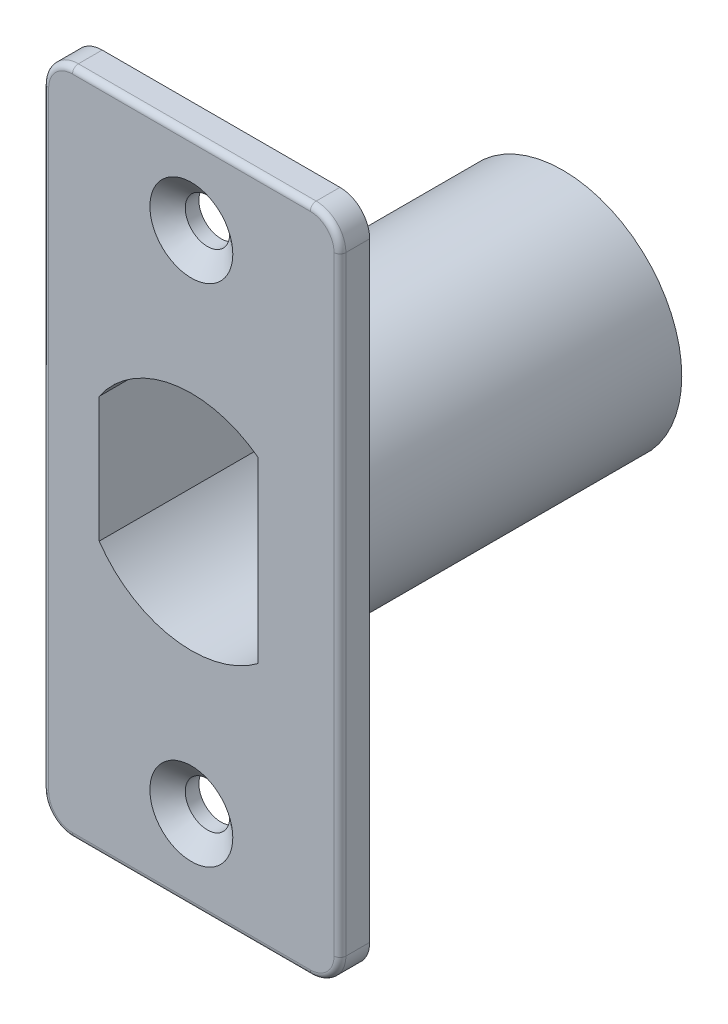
ISO-10303-21;
HEADER;
FILE_DESCRIPTION(('STEP AP214'),'2;1');
FILE_NAME('part.step','',(''),(''),'','','');
FILE_SCHEMA(('AUTOMOTIVE_DESIGN { 1 0 10303 214 1 1 1 1 }'));
ENDSEC;
DATA;
#1=APPLICATION_CONTEXT('core data for automotive mechanical design processes');
#2=APPLICATION_PROTOCOL_DEFINITION('international standard','automotive_design',2000,#1);
#3=PRODUCT_CONTEXT('',#1,'mechanical');
#4=PRODUCT('Part','Part','',(#3));
#5=PRODUCT_RELATED_PRODUCT_CATEGORY('part','',(#4));
#6=PRODUCT_DEFINITION_FORMATION('','',#4);
#7=PRODUCT_DEFINITION_CONTEXT('part definition',#1,'design');
#8=PRODUCT_DEFINITION('design','',#6,#7);
#9=PRODUCT_DEFINITION_SHAPE('','',#8);
#10=(LENGTH_UNIT() NAMED_UNIT(*) SI_UNIT(.MILLI.,.METRE.));
#11=(NAMED_UNIT(*) PLANE_ANGLE_UNIT() SI_UNIT($,.RADIAN.));
#12=(NAMED_UNIT(*) SI_UNIT($,.STERADIAN.) SOLID_ANGLE_UNIT());
#13=UNCERTAINTY_MEASURE_WITH_UNIT(LENGTH_MEASURE(1.E-05),#10,'distance_accuracy_value','');
#14=(GEOMETRIC_REPRESENTATION_CONTEXT(3) GLOBAL_UNCERTAINTY_ASSIGNED_CONTEXT((#13)) GLOBAL_UNIT_ASSIGNED_CONTEXT((#10,
#11,#12)) REPRESENTATION_CONTEXT('',''));
#15=CARTESIAN_POINT('',(0.,0.,0.));
#16=DIRECTION('',(0.,0.,1.));
#17=DIRECTION('',(1.,0.,0.));
#18=AXIS2_PLACEMENT_3D('',#15,#16,#17);
#19=CARTESIAN_POINT('',(5.715,7.62,-29.21));
#20=DIRECTION('',(1.,0.,0.));
#21=DIRECTION('',(0.,0.,-1.));
#22=AXIS2_PLACEMENT_3D('',#19,#20,#21);
#23=PLANE('',#22);
#24=DIRECTION('',(0.,-1.,0.));
#25=VECTOR('',#24,1.);
#26=CARTESIAN_POINT('',(5.715,-7.62,-27.94));
#27=LINE('',#26,#25);
#28=CARTESIAN_POINT('',(5.715,7.62,-27.94));
#29=VERTEX_POINT('',#28);
#30=CARTESIAN_POINT('',(5.715,-7.62,-27.94));
#31=VERTEX_POINT('',#30);
#32=EDGE_CURVE('E170',#29,#31,#27,.T.);
#33=ORIENTED_EDGE('',*,*,#32,.T.);
#34=DIRECTION('',(0.,0.,1.));
#35=VECTOR('',#34,1.);
#36=CARTESIAN_POINT('',(5.715,-7.62,-29.21));
#37=LINE('',#36,#35);
#38=CARTESIAN_POINT('',(5.715,-7.62,2.54));
#39=VERTEX_POINT('',#38);
#40=EDGE_CURVE('E182',#31,#39,#37,.T.);
#41=ORIENTED_EDGE('',*,*,#40,.T.);
#42=DIRECTION('',(0.,1.,0.));
#43=VECTOR('',#42,1.);
#44=CARTESIAN_POINT('',(5.715,7.62,2.54));
#45=LINE('',#44,#43);
#46=CARTESIAN_POINT('',(5.715,7.62,2.54));
#47=VERTEX_POINT('',#46);
#48=EDGE_CURVE('E206',#39,#47,#45,.T.);
#49=ORIENTED_EDGE('',*,*,#48,.T.);
#50=DIRECTION('',(0.,0.,1.));
#51=VECTOR('',#50,1.);
#52=CARTESIAN_POINT('',(5.715,7.62,-29.21));
#53=LINE('',#52,#51);
#54=EDGE_CURVE('E221',#29,#47,#53,.T.);
#55=ORIENTED_EDGE('',*,*,#54,.F.);
#56=EDGE_LOOP('',(#33,#41,#49,#55));
#57=FACE_BOUND('',#56,.T.);
#58=ADVANCED_FACE('F32',(#57),#23,.F.);
#59=CARTESIAN_POINT('',(12.7,-28.575,2.54));
#60=DIRECTION('',(-1.,0.,0.));
#61=DIRECTION('',(0.,0.,1.));
#62=AXIS2_PLACEMENT_3D('',#59,#60,#61);
#63=PLANE('',#62);
#64=DIRECTION('',(0.,0.,-1.));
#65=VECTOR('',#64,1.);
#66=CARTESIAN_POINT('',(12.7,26.035,2.54));
#67=LINE('',#66,#65);
#68=CARTESIAN_POINT('',(12.7,26.035,0.));
#69=VERTEX_POINT('',#68);
#70=CARTESIAN_POINT('',(12.7,26.035,2.032));
#71=VERTEX_POINT('',#70);
#72=EDGE_CURVE('E246',#69,#71,#67,.F.);
#73=ORIENTED_EDGE('',*,*,#72,.T.);
#74=DIRECTION('',(0.,1.,0.));
#75=VECTOR('',#74,1.);
#76=CARTESIAN_POINT('',(12.7,-28.575,2.032));
#77=LINE('',#76,#75);
#78=CARTESIAN_POINT('',(12.7,-26.035,2.032));
#79=VERTEX_POINT('',#78);
#80=EDGE_CURVE('E300',#71,#79,#77,.F.);
#81=ORIENTED_EDGE('',*,*,#80,.T.);
#82=DIRECTION('',(0.,0.,-1.));
#83=VECTOR('',#82,1.);
#84=CARTESIAN_POINT('',(12.7,-26.035,2.54));
#85=LINE('',#84,#83);
#86=CARTESIAN_POINT('',(12.7,-26.035,0.));
#87=VERTEX_POINT('',#86);
#88=EDGE_CURVE('E253',#79,#87,#85,.T.);
#89=ORIENTED_EDGE('',*,*,#88,.T.);
#90=DIRECTION('',(0.,1.,0.));
#91=VECTOR('',#90,1.);
#92=CARTESIAN_POINT('',(12.7,-28.575,0.));
#93=LINE('',#92,#91);
#94=EDGE_CURVE('E231',#87,#69,#93,.T.);
#95=ORIENTED_EDGE('',*,*,#94,.T.);
#96=EDGE_LOOP('',(#73,#81,#89,#95));
#97=FACE_BOUND('',#96,.T.);
#98=ADVANCED_FACE('F352',(#97),#63,.F.);
#99=CARTESIAN_POINT('',(-12.7,28.575,2.54));
#100=DIRECTION('',(0.,-1.,0.));
#101=DIRECTION('',(0.,0.,-1.));
#102=AXIS2_PLACEMENT_3D('',#99,#100,#101);
#103=PLANE('',#102);
#104=DIRECTION('',(0.,0.,-1.));
#105=VECTOR('',#104,1.);
#106=CARTESIAN_POINT('',(-10.16,28.575,2.54));
#107=LINE('',#106,#105);
#108=CARTESIAN_POINT('',(-10.16,28.575,0.));
#109=VERTEX_POINT('',#108);
#110=CARTESIAN_POINT('',(-10.16,28.575,2.032));
#111=VERTEX_POINT('',#110);
#112=EDGE_CURVE('E273',#109,#111,#107,.F.);
#113=ORIENTED_EDGE('',*,*,#112,.T.);
#114=DIRECTION('',(-1.,0.,0.));
#115=VECTOR('',#114,1.);
#116=CARTESIAN_POINT('',(-12.7,28.575,2.032));
#117=LINE('',#116,#115);
#118=CARTESIAN_POINT('',(10.16,28.575,2.032));
#119=VERTEX_POINT('',#118);
#120=EDGE_CURVE('E296',#111,#119,#117,.F.);
#121=ORIENTED_EDGE('',*,*,#120,.T.);
#122=DIRECTION('',(0.,0.,-1.));
#123=VECTOR('',#122,1.);
#124=CARTESIAN_POINT('',(10.16,28.575,2.54));
#125=LINE('',#124,#123);
#126=CARTESIAN_POINT('',(10.16,28.575,0.));
#127=VERTEX_POINT('',#126);
#128=EDGE_CURVE('E271',#119,#127,#125,.T.);
#129=ORIENTED_EDGE('',*,*,#128,.T.);
#130=DIRECTION('',(-1.,0.,0.));
#131=VECTOR('',#130,1.);
#132=CARTESIAN_POINT('',(-12.7,28.575,0.));
#133=LINE('',#132,#131);
#134=EDGE_CURVE('E234',#127,#109,#133,.T.);
#135=ORIENTED_EDGE('',*,*,#134,.T.);
#136=EDGE_LOOP('',(#113,#121,#129,#135));
#137=FACE_BOUND('',#136,.T.);
#138=ADVANCED_FACE('F404',(#137),#103,.F.);
#139=CARTESIAN_POINT('',(-12.7,-28.575,2.54));
#140=DIRECTION('',(1.,0.,0.));
#141=DIRECTION('',(0.,0.,-1.));
#142=AXIS2_PLACEMENT_3D('',#139,#140,#141);
#143=PLANE('',#142);
#144=DIRECTION('',(0.,0.,-1.));
#145=VECTOR('',#144,1.);
#146=CARTESIAN_POINT('',(-12.7,-26.035,2.54));
#147=LINE('',#146,#145);
#148=CARTESIAN_POINT('',(-12.7,-26.035,0.));
#149=VERTEX_POINT('',#148);
#150=CARTESIAN_POINT('',(-12.7,-26.035,2.032));
#151=VERTEX_POINT('',#150);
#152=EDGE_CURVE('E269',#149,#151,#147,.F.);
#153=ORIENTED_EDGE('',*,*,#152,.T.);
#154=DIRECTION('',(0.,-1.,0.));
#155=VECTOR('',#154,1.);
#156=CARTESIAN_POINT('',(-12.7,-28.575,2.032));
#157=LINE('',#156,#155);
#158=CARTESIAN_POINT('',(-12.7,26.035,2.032));
#159=VERTEX_POINT('',#158);
#160=EDGE_CURVE('E11',#151,#159,#157,.F.);
#161=ORIENTED_EDGE('',*,*,#160,.T.);
#162=DIRECTION('',(0.,0.,-1.));
#163=VECTOR('',#162,1.);
#164=CARTESIAN_POINT('',(-12.7,26.035,2.54));
#165=LINE('',#164,#163);
#166=CARTESIAN_POINT('',(-12.7,26.035,0.));
#167=VERTEX_POINT('',#166);
#168=EDGE_CURVE('E267',#159,#167,#165,.T.);
#169=ORIENTED_EDGE('',*,*,#168,.T.);
#170=DIRECTION('',(0.,-1.,0.));
#171=VECTOR('',#170,1.);
#172=CARTESIAN_POINT('',(-12.7,-28.575,0.));
#173=LINE('',#172,#171);
#174=EDGE_CURVE('E237',#167,#149,#173,.T.);
#175=ORIENTED_EDGE('',*,*,#174,.T.);
#176=EDGE_LOOP('',(#153,#161,#169,#175));
#177=FACE_BOUND('',#176,.T.);
#178=ADVANCED_FACE('F383',(#177),#143,.F.);
#179=CARTESIAN_POINT('',(-12.7,-28.575,2.54));
#180=DIRECTION('',(0.,1.,0.));
#181=DIRECTION('',(0.,0.,1.));
#182=AXIS2_PLACEMENT_3D('',#179,#180,#181);
#183=PLANE('',#182);
#184=DIRECTION('',(0.,0.,-1.));
#185=VECTOR('',#184,1.);
#186=CARTESIAN_POINT('',(10.16,-28.575,2.54));
#187=LINE('',#186,#185);
#188=CARTESIAN_POINT('',(10.16,-28.575,0.));
#189=VERTEX_POINT('',#188);
#190=CARTESIAN_POINT('',(10.16,-28.575,2.032));
#191=VERTEX_POINT('',#190);
#192=EDGE_CURVE('E265',#189,#191,#187,.F.);
#193=ORIENTED_EDGE('',*,*,#192,.T.);
#194=DIRECTION('',(1.,0.,0.));
#195=VECTOR('',#194,1.);
#196=CARTESIAN_POINT('',(-12.7,-28.575,2.032));
#197=LINE('',#196,#195);
#198=CARTESIAN_POINT('',(-10.16,-28.575,2.032));
#199=VERTEX_POINT('',#198);
#200=EDGE_CURVE('E56',#191,#199,#197,.F.);
#201=ORIENTED_EDGE('',*,*,#200,.T.);
#202=DIRECTION('',(0.,0.,-1.));
#203=VECTOR('',#202,1.);
#204=CARTESIAN_POINT('',(-10.16,-28.575,2.54));
#205=LINE('',#204,#203);
#206=CARTESIAN_POINT('',(-10.16,-28.575,0.));
#207=VERTEX_POINT('',#206);
#208=EDGE_CURVE('E263',#199,#207,#205,.T.);
#209=ORIENTED_EDGE('',*,*,#208,.T.);
#210=DIRECTION('',(1.,0.,0.));
#211=VECTOR('',#210,1.);
#212=CARTESIAN_POINT('',(-12.7,-28.575,0.));
#213=LINE('',#212,#211);
#214=EDGE_CURVE('E240',#207,#189,#213,.T.);
#215=ORIENTED_EDGE('',*,*,#214,.T.);
#216=EDGE_LOOP('',(#193,#201,#209,#215));
#217=FACE_BOUND('',#216,.T.);
#218=ADVANCED_FACE('F341',(#217),#183,.F.);
#219=CARTESIAN_POINT('',(12.7,28.575,2.54));
#220=DIRECTION('',(0.,0.,-1.));
#221=DIRECTION('',(-1.,0.,0.));
#222=AXIS2_PLACEMENT_3D('',#219,#220,#221);
#223=PLANE('',#222);
#224=DIRECTION('',(-1.,0.,0.));
#225=VECTOR('',#224,1.);
#226=CARTESIAN_POINT('',(12.7,28.067,2.54));
#227=LINE('',#226,#225);
#228=CARTESIAN_POINT('',(10.16,28.067,2.54));
#229=VERTEX_POINT('',#228);
#230=CARTESIAN_POINT('',(-10.16,28.067,2.54));
#231=VERTEX_POINT('',#230);
#232=EDGE_CURVE('E288',#229,#231,#227,.T.);
#233=ORIENTED_EDGE('',*,*,#232,.T.);
#234=CARTESIAN_POINT('',(-10.16,26.035,2.54));
#235=DIRECTION('',(0.,0.,-1.));
#236=DIRECTION('',(-1.,0.,0.));
#237=AXIS2_PLACEMENT_3D('',#234,#235,#236);
#238=CIRCLE('',#237,2.032);
#239=CARTESIAN_POINT('',(-12.192,26.035,2.54));
#240=VERTEX_POINT('',#239);
#241=EDGE_CURVE('E290',#231,#240,#238,.F.);
#242=ORIENTED_EDGE('',*,*,#241,.T.);
#243=DIRECTION('',(0.,-1.,0.));
#244=VECTOR('',#243,1.);
#245=CARTESIAN_POINT('',(-12.192,28.575,2.54));
#246=LINE('',#245,#244);
#247=CARTESIAN_POINT('',(-12.192,-26.035,2.54));
#248=VERTEX_POINT('',#247);
#249=EDGE_CURVE('E276',#240,#248,#246,.T.);
#250=ORIENTED_EDGE('',*,*,#249,.T.);
#251=CARTESIAN_POINT('',(-10.16,-26.035,2.54));
#252=DIRECTION('',(0.,0.,-1.));
#253=DIRECTION('',(-1.,0.,0.));
#254=AXIS2_PLACEMENT_3D('',#251,#252,#253);
#255=CIRCLE('',#254,2.032);
#256=CARTESIAN_POINT('',(-10.16,-28.067,2.54));
#257=VERTEX_POINT('',#256);
#258=EDGE_CURVE('E278',#248,#257,#255,.F.);
#259=ORIENTED_EDGE('',*,*,#258,.T.);
#260=DIRECTION('',(1.,0.,0.));
#261=VECTOR('',#260,1.);
#262=CARTESIAN_POINT('',(12.7,-28.067,2.54));
#263=LINE('',#262,#261);
#264=CARTESIAN_POINT('',(10.16,-28.067,2.54));
#265=VERTEX_POINT('',#264);
#266=EDGE_CURVE('E280',#257,#265,#263,.T.);
#267=ORIENTED_EDGE('',*,*,#266,.T.);
#268=CARTESIAN_POINT('',(10.16,-26.035,2.54));
#269=DIRECTION('',(0.,0.,-1.));
#270=DIRECTION('',(-1.,0.,0.));
#271=AXIS2_PLACEMENT_3D('',#268,#269,#270);
#272=CIRCLE('',#271,2.032);
#273=CARTESIAN_POINT('',(12.192,-26.035,2.54));
#274=VERTEX_POINT('',#273);
#275=EDGE_CURVE('E282',#265,#274,#272,.F.);
#276=ORIENTED_EDGE('',*,*,#275,.T.);
#277=DIRECTION('',(0.,1.,0.));
#278=VECTOR('',#277,1.);
#279=CARTESIAN_POINT('',(12.192,28.575,2.54));
#280=LINE('',#279,#278);
#281=CARTESIAN_POINT('',(12.192,26.035,2.54));
#282=VERTEX_POINT('',#281);
#283=EDGE_CURVE('E284',#274,#282,#280,.T.);
#284=ORIENTED_EDGE('',*,*,#283,.T.);
#285=CARTESIAN_POINT('',(10.16,26.035,2.54));
#286=DIRECTION('',(0.,0.,-1.));
#287=DIRECTION('',(-1.,0.,0.));
#288=AXIS2_PLACEMENT_3D('',#285,#286,#287);
#289=CIRCLE('',#288,2.032);
#290=EDGE_CURVE('E286',#282,#229,#289,.F.);
#291=ORIENTED_EDGE('',*,*,#290,.T.);
#292=EDGE_LOOP('',(#233,#242,#250,#259,#267,#276,#284,#291));
#293=FACE_BOUND('',#292,.T.);
#294=CARTESIAN_POINT('',(0.,21.59,2.54));
#295=DIRECTION('',(0.,0.,1.));
#296=DIRECTION('',(1.,0.,0.));
#297=AXIS2_PLACEMENT_3D('',#294,#295,#296);
#298=CIRCLE('',#297,3.5433);
#299=CARTESIAN_POINT('',(3.5433,21.59,2.54));
#300=VERTEX_POINT('',#299);
#301=EDGE_CURVE('E188',#300,#300,#298,.T.);
#302=ORIENTED_EDGE('',*,*,#301,.F.);
#303=EDGE_LOOP('',(#302));
#304=FACE_BOUND('',#303,.T.);
#305=CARTESIAN_POINT('',(0.,-21.59,2.54));
#306=DIRECTION('',(0.,0.,1.));
#307=DIRECTION('',(1.,0.,0.));
#308=AXIS2_PLACEMENT_3D('',#305,#306,#307);
#309=CIRCLE('',#308,3.5433);
#310=CARTESIAN_POINT('',(3.5433,-21.59,2.54));
#311=VERTEX_POINT('',#310);
#312=EDGE_CURVE('E196',#311,#311,#309,.T.);
#313=ORIENTED_EDGE('',*,*,#312,.F.);
#314=EDGE_LOOP('',(#313));
#315=FACE_BOUND('',#314,.T.);
#316=DIRECTION('',(0.,-1.,0.));
#317=VECTOR('',#316,1.);
#318=CARTESIAN_POINT('',(-7.87416386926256,5.3594,2.54));
#319=LINE('',#318,#317);
#320=CARTESIAN_POINT('',(-7.87416386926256,5.3594,2.54));
#321=VERTEX_POINT('',#320);
#322=CARTESIAN_POINT('',(-7.87416386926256,-5.3594,2.54));
#323=VERTEX_POINT('',#322);
#324=EDGE_CURVE('E214',#321,#323,#319,.T.);
#325=ORIENTED_EDGE('',*,*,#324,.F.);
#326=CARTESIAN_POINT('',(0.,0.,2.54));
#327=DIRECTION('',(0.,0.,1.));
#328=DIRECTION('',(1.,0.,0.));
#329=AXIS2_PLACEMENT_3D('',#326,#327,#328);
#330=CIRCLE('',#329,9.525);
#331=EDGE_CURVE('E212',#47,#321,#330,.T.);
#332=ORIENTED_EDGE('',*,*,#331,.F.);
#333=ORIENTED_EDGE('',*,*,#48,.F.);
#334=CARTESIAN_POINT('',(0.,0.,2.54));
#335=DIRECTION('',(0.,0.,1.));
#336=DIRECTION('',(1.,0.,0.));
#337=AXIS2_PLACEMENT_3D('',#334,#335,#336);
#338=CIRCLE('',#337,9.525);
#339=EDGE_CURVE('E217',#323,#39,#338,.T.);
#340=ORIENTED_EDGE('',*,*,#339,.F.);
#341=EDGE_LOOP('',(#325,#332,#333,#340));
#342=FACE_BOUND('',#341,.T.);
#343=ADVANCED_FACE('F368',(#293,#304,#315,#342),#223,.F.);
#344=CARTESIAN_POINT('',(12.7,28.575,0.));
#345=DIRECTION('',(0.,0.,-1.));
#346=DIRECTION('',(-1.,0.,0.));
#347=AXIS2_PLACEMENT_3D('',#344,#345,#346);
#348=PLANE('',#347);
#349=CARTESIAN_POINT('',(0.,21.59,0.));
#350=DIRECTION('',(0.,0.,-1.));
#351=DIRECTION('',(-1.,0.,0.));
#352=AXIS2_PLACEMENT_3D('',#349,#350,#351);
#353=CIRCLE('',#352,1.89864999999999);
#354=CARTESIAN_POINT('',(-1.89864999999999,21.59,0.));
#355=VERTEX_POINT('',#354);
#356=EDGE_CURVE('E195',#355,#355,#353,.T.);
#357=ORIENTED_EDGE('',*,*,#356,.F.);
#358=EDGE_LOOP('',(#357));
#359=FACE_BOUND('',#358,.T.);
#360=CARTESIAN_POINT('',(0.,-21.59,0.));
#361=DIRECTION('',(0.,0.,-1.));
#362=DIRECTION('',(-1.,0.,0.));
#363=AXIS2_PLACEMENT_3D('',#360,#361,#362);
#364=CIRCLE('',#363,1.89864999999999);
#365=CARTESIAN_POINT('',(-1.89864999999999,-21.59,0.));
#366=VERTEX_POINT('',#365);
#367=EDGE_CURVE('E202',#366,#366,#364,.T.);
#368=ORIENTED_EDGE('',*,*,#367,.F.);
#369=EDGE_LOOP('',(#368));
#370=FACE_BOUND('',#369,.T.);
#371=CARTESIAN_POINT('',(0.,0.,0.));
#372=DIRECTION('',(0.,0.,-1.));
#373=DIRECTION('',(-1.,0.,0.));
#374=AXIS2_PLACEMENT_3D('',#371,#372,#373);
#375=CIRCLE('',#374,10.16);
#376=CARTESIAN_POINT('',(-10.16,0.,0.));
#377=VERTEX_POINT('',#376);
#378=EDGE_CURVE('E243',#377,#377,#375,.T.);
#379=ORIENTED_EDGE('',*,*,#378,.F.);
#380=EDGE_LOOP('',(#379));
#381=FACE_BOUND('',#380,.T.);
#382=ORIENTED_EDGE('',*,*,#94,.F.);
#383=CARTESIAN_POINT('',(10.16,-26.035,0.));
#384=DIRECTION('',(0.,0.,-1.));
#385=DIRECTION('',(-1.,0.,0.));
#386=AXIS2_PLACEMENT_3D('',#383,#384,#385);
#387=CIRCLE('',#386,2.54);
#388=EDGE_CURVE('E261',#87,#189,#387,.T.);
#389=ORIENTED_EDGE('',*,*,#388,.T.);
#390=ORIENTED_EDGE('',*,*,#214,.F.);
#391=CARTESIAN_POINT('',(-10.16,-26.035,0.));
#392=DIRECTION('',(0.,0.,-1.));
#393=DIRECTION('',(-1.,0.,0.));
#394=AXIS2_PLACEMENT_3D('',#391,#392,#393);
#395=CIRCLE('',#394,2.54);
#396=EDGE_CURVE('E259',#207,#149,#395,.T.);
#397=ORIENTED_EDGE('',*,*,#396,.T.);
#398=ORIENTED_EDGE('',*,*,#174,.F.);
#399=CARTESIAN_POINT('',(-10.16,26.035,0.));
#400=DIRECTION('',(0.,0.,-1.));
#401=DIRECTION('',(-1.,0.,0.));
#402=AXIS2_PLACEMENT_3D('',#399,#400,#401);
#403=CIRCLE('',#402,2.54);
#404=EDGE_CURVE('E257',#167,#109,#403,.T.);
#405=ORIENTED_EDGE('',*,*,#404,.T.);
#406=ORIENTED_EDGE('',*,*,#134,.F.);
#407=CARTESIAN_POINT('',(10.16,26.035,0.));
#408=DIRECTION('',(0.,0.,-1.));
#409=DIRECTION('',(-1.,0.,0.));
#410=AXIS2_PLACEMENT_3D('',#407,#408,#409);
#411=CIRCLE('',#410,2.54);
#412=EDGE_CURVE('E255',#127,#69,#411,.T.);
#413=ORIENTED_EDGE('',*,*,#412,.T.);
#414=EDGE_LOOP('',(#382,#389,#390,#397,#398,#405,#406,#413));
#415=FACE_BOUND('',#414,.T.);
#416=ADVANCED_FACE('F346',(#359,#370,#381,#415),#348,.T.);
#417=CARTESIAN_POINT('',(0.,0.,-29.21));
#418=DIRECTION('',(0.,0.,1.));
#419=DIRECTION('',(1.,0.,0.));
#420=AXIS2_PLACEMENT_3D('',#417,#418,#419);
#421=CYLINDRICAL_SURFACE('',#420,10.16);
#422=ORIENTED_EDGE('',*,*,#378,.T.);
#423=EDGE_LOOP('',(#422));
#424=FACE_BOUND('',#423,.T.);
#425=CARTESIAN_POINT('',(0.,0.,-29.21));
#426=DIRECTION('',(0.,0.,1.));
#427=DIRECTION('',(1.,0.,0.));
#428=AXIS2_PLACEMENT_3D('',#425,#426,#427);
#429=CIRCLE('',#428,10.16);
#430=CARTESIAN_POINT('',(10.16,0.,-29.21));
#431=VERTEX_POINT('',#430);
#432=EDGE_CURVE('E223',#431,#431,#429,.T.);
#433=ORIENTED_EDGE('',*,*,#432,.T.);
#434=EDGE_LOOP('',(#433));
#435=FACE_BOUND('',#434,.T.);
#436=ADVANCED_FACE('F423',(#424,#435),#421,.T.);
#437=CARTESIAN_POINT('',(0.,0.,-29.21));
#438=DIRECTION('',(0.,0.,1.));
#439=DIRECTION('',(1.,0.,0.));
#440=AXIS2_PLACEMENT_3D('',#437,#438,#439);
#441=PLANE('',#440);
#442=DIRECTION('',(0.,1.,0.));
#443=VECTOR('',#442,1.);
#444=CARTESIAN_POINT('',(0.,9.525,-29.21));
#445=LINE('',#444,#443);
#446=CARTESIAN_POINT('',(0.,-9.525,-29.21));
#447=VERTEX_POINT('',#446);
#448=CARTESIAN_POINT('',(0.,9.525,-29.21));
#449=VERTEX_POINT('',#448);
#450=EDGE_CURVE('E165',#447,#449,#445,.T.);
#451=ORIENTED_EDGE('',*,*,#450,.T.);
#452=CARTESIAN_POINT('',(0.,0.,-29.21));
#453=DIRECTION('',(0.,0.,1.));
#454=DIRECTION('',(1.,0.,0.));
#455=AXIS2_PLACEMENT_3D('',#452,#453,#454);
#456=CIRCLE('',#455,9.525);
#457=CARTESIAN_POINT('',(-7.87416386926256,5.3594,-29.21));
#458=VERTEX_POINT('',#457);
#459=EDGE_CURVE('E203',#449,#458,#456,.T.);
#460=ORIENTED_EDGE('',*,*,#459,.T.);
#461=DIRECTION('',(0.,-1.,0.));
#462=VECTOR('',#461,1.);
#463=CARTESIAN_POINT('',(-7.87416386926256,5.3594,-29.21));
#464=LINE('',#463,#462);
#465=CARTESIAN_POINT('',(-7.87416386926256,-5.3594,-29.21));
#466=VERTEX_POINT('',#465);
#467=EDGE_CURVE('E205',#458,#466,#464,.T.);
#468=ORIENTED_EDGE('',*,*,#467,.T.);
#469=CARTESIAN_POINT('',(0.,0.,-29.21));
#470=DIRECTION('',(0.,0.,1.));
#471=DIRECTION('',(1.,0.,0.));
#472=AXIS2_PLACEMENT_3D('',#469,#470,#471);
#473=CIRCLE('',#472,9.525);
#474=EDGE_CURVE('E209',#466,#447,#473,.T.);
#475=ORIENTED_EDGE('',*,*,#474,.T.);
#476=EDGE_LOOP('',(#451,#460,#468,#475));
#477=FACE_BOUND('',#476,.T.);
#478=ORIENTED_EDGE('',*,*,#432,.F.);
#479=EDGE_LOOP('',(#478));
#480=FACE_BOUND('',#479,.T.);
#481=ADVANCED_FACE('F419',(#477,#480),#441,.F.);
#482=CARTESIAN_POINT('',(0.,0.,-29.21));
#483=DIRECTION('',(0.,0.,1.));
#484=DIRECTION('',(1.,0.,0.));
#485=AXIS2_PLACEMENT_3D('',#482,#483,#484);
#486=CYLINDRICAL_SURFACE('',#485,9.525);
#487=ORIENTED_EDGE('',*,*,#459,.F.);
#488=DIRECTION('',(0.,0.,-1.));
#489=VECTOR('',#488,1.);
#490=CARTESIAN_POINT('',(0.,9.525,-27.94));
#491=LINE('',#490,#489);
#492=CARTESIAN_POINT('',(0.,9.525,-27.94));
#493=VERTEX_POINT('',#492);
#494=EDGE_CURVE('E169',#493,#449,#491,.T.);
#495=ORIENTED_EDGE('',*,*,#494,.F.);
#496=CARTESIAN_POINT('',(0.,0.,-27.94));
#497=DIRECTION('',(0.,0.,-1.));
#498=DIRECTION('',(-1.,0.,0.));
#499=AXIS2_PLACEMENT_3D('',#496,#497,#498);
#500=CIRCLE('',#499,9.525);
#501=EDGE_CURVE('E177',#493,#29,#500,.T.);
#502=ORIENTED_EDGE('',*,*,#501,.T.);
#503=ORIENTED_EDGE('',*,*,#54,.T.);
#504=ORIENTED_EDGE('',*,*,#331,.T.);
#505=DIRECTION('',(0.,0.,1.));
#506=VECTOR('',#505,1.);
#507=CARTESIAN_POINT('',(-7.87416386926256,5.3594,-29.21));
#508=LINE('',#507,#506);
#509=EDGE_CURVE('E211',#458,#321,#508,.T.);
#510=ORIENTED_EDGE('',*,*,#509,.F.);
#511=EDGE_LOOP('',(#487,#495,#502,#503,#504,#510));
#512=FACE_BOUND('',#511,.T.);
#513=ADVANCED_FACE('F413',(#512),#486,.F.);
#514=CARTESIAN_POINT('',(0.,0.,-29.21));
#515=DIRECTION('',(0.,0.,1.));
#516=DIRECTION('',(1.,0.,0.));
#517=AXIS2_PLACEMENT_3D('',#514,#515,#516);
#518=CYLINDRICAL_SURFACE('',#517,9.525);
#519=CARTESIAN_POINT('',(0.,0.,-27.94));
#520=DIRECTION('',(0.,0.,-1.));
#521=DIRECTION('',(-1.,0.,0.));
#522=AXIS2_PLACEMENT_3D('',#519,#520,#521);
#523=CIRCLE('',#522,9.525);
#524=CARTESIAN_POINT('',(0.,-9.525,-27.94));
#525=VERTEX_POINT('',#524);
#526=EDGE_CURVE('E174',#31,#525,#523,.T.);
#527=ORIENTED_EDGE('',*,*,#526,.T.);
#528=DIRECTION('',(0.,0.,-1.));
#529=VECTOR('',#528,1.);
#530=CARTESIAN_POINT('',(0.,-9.525,-27.94));
#531=LINE('',#530,#529);
#532=EDGE_CURVE('E159',#525,#447,#531,.T.);
#533=ORIENTED_EDGE('',*,*,#532,.T.);
#534=ORIENTED_EDGE('',*,*,#474,.F.);
#535=DIRECTION('',(0.,0.,1.));
#536=VECTOR('',#535,1.);
#537=CARTESIAN_POINT('',(-7.87416386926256,-5.3594,-29.21));
#538=LINE('',#537,#536);
#539=EDGE_CURVE('E225',#466,#323,#538,.T.);
#540=ORIENTED_EDGE('',*,*,#539,.T.);
#541=ORIENTED_EDGE('',*,*,#339,.T.);
#542=ORIENTED_EDGE('',*,*,#40,.F.);
#543=EDGE_LOOP('',(#527,#533,#534,#540,#541,#542));
#544=FACE_BOUND('',#543,.T.);
#545=ADVANCED_FACE('F180',(#544),#518,.F.);
#546=CARTESIAN_POINT('',(-7.87416386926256,5.3594,-29.21));
#547=DIRECTION('',(-1.,0.,0.));
#548=DIRECTION('',(0.,0.,1.));
#549=AXIS2_PLACEMENT_3D('',#546,#547,#548);
#550=PLANE('',#549);
#551=ORIENTED_EDGE('',*,*,#324,.T.);
#552=ORIENTED_EDGE('',*,*,#539,.F.);
#553=ORIENTED_EDGE('',*,*,#467,.F.);
#554=ORIENTED_EDGE('',*,*,#509,.T.);
#555=EDGE_LOOP('',(#551,#552,#553,#554));
#556=FACE_BOUND('',#555,.T.);
#557=ADVANCED_FACE('F412',(#556),#550,.F.);
#558=CARTESIAN_POINT('',(0.,-21.59,2.54));
#559=DIRECTION('',(0.,0.,1.));
#560=DIRECTION('',(1.,0.,0.));
#561=AXIS2_PLACEMENT_3D('',#558,#559,#560);
#562=CYLINDRICAL_SURFACE('',#561,1.89864999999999);
#563=ORIENTED_EDGE('',*,*,#367,.T.);
#564=EDGE_LOOP('',(#563));
#565=FACE_BOUND('',#564,.T.);
#566=CARTESIAN_POINT('',(0.,-21.59,1.15997479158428));
#567=DIRECTION('',(0.,0.,1.));
#568=DIRECTION('',(1.,0.,0.));
#569=AXIS2_PLACEMENT_3D('',#566,#567,#568);
#570=CIRCLE('',#569,1.89865);
#571=CARTESIAN_POINT('',(1.89865,-21.59,1.15997479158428));
#572=VERTEX_POINT('',#571);
#573=EDGE_CURVE('E199',#572,#572,#570,.T.);
#574=ORIENTED_EDGE('',*,*,#573,.T.);
#575=EDGE_LOOP('',(#574));
#576=FACE_BOUND('',#575,.T.);
#577=ADVANCED_FACE('F408',(#565,#576),#562,.F.);
#578=CARTESIAN_POINT('',(0.,-21.59,2.54));
#579=DIRECTION('',(0.,0.,1.));
#580=DIRECTION('',(1.,0.,0.));
#581=AXIS2_PLACEMENT_3D('',#578,#579,#580);
#582=CONICAL_SURFACE('',#581,3.5433,0.872664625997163);
#583=ORIENTED_EDGE('',*,*,#573,.F.);
#584=EDGE_LOOP('',(#583));
#585=FACE_BOUND('',#584,.T.);
#586=ORIENTED_EDGE('',*,*,#312,.T.);
#587=EDGE_LOOP('',(#586));
#588=FACE_BOUND('',#587,.T.);
#589=ADVANCED_FACE('F570',(#585,#588),#582,.F.);
#590=CARTESIAN_POINT('',(0.,21.59,2.54));
#591=DIRECTION('',(0.,0.,1.));
#592=DIRECTION('',(1.,0.,0.));
#593=AXIS2_PLACEMENT_3D('',#590,#591,#592);
#594=CYLINDRICAL_SURFACE('',#593,1.89864999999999);
#595=ORIENTED_EDGE('',*,*,#356,.T.);
#596=EDGE_LOOP('',(#595));
#597=FACE_BOUND('',#596,.T.);
#598=CARTESIAN_POINT('',(0.,21.59,1.15997479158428));
#599=DIRECTION('',(0.,0.,1.));
#600=DIRECTION('',(1.,0.,0.));
#601=AXIS2_PLACEMENT_3D('',#598,#599,#600);
#602=CIRCLE('',#601,1.89865);
#603=CARTESIAN_POINT('',(1.89865,21.59,1.15997479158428));
#604=VERTEX_POINT('',#603);
#605=EDGE_CURVE('E192',#604,#604,#602,.T.);
#606=ORIENTED_EDGE('',*,*,#605,.T.);
#607=EDGE_LOOP('',(#606));
#608=FACE_BOUND('',#607,.T.);
#609=ADVANCED_FACE('F561',(#597,#608),#594,.F.);
#610=CARTESIAN_POINT('',(0.,21.59,2.54));
#611=DIRECTION('',(0.,0.,1.));
#612=DIRECTION('',(1.,0.,0.));
#613=AXIS2_PLACEMENT_3D('',#610,#611,#612);
#614=CONICAL_SURFACE('',#613,3.5433,0.872664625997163);
#615=ORIENTED_EDGE('',*,*,#605,.F.);
#616=EDGE_LOOP('',(#615));
#617=FACE_BOUND('',#616,.T.);
#618=ORIENTED_EDGE('',*,*,#301,.T.);
#619=EDGE_LOOP('',(#618));
#620=FACE_BOUND('',#619,.T.);
#621=ADVANCED_FACE('F537',(#617,#620),#614,.F.);
#622=CARTESIAN_POINT('',(0.,9.525,-27.94));
#623=DIRECTION('',(-1.,0.,0.));
#624=DIRECTION('',(0.,-1.,0.));
#625=AXIS2_PLACEMENT_3D('',#622,#623,#624);
#626=PLANE('',#625);
#627=ORIENTED_EDGE('',*,*,#450,.F.);
#628=ORIENTED_EDGE('',*,*,#532,.F.);
#629=DIRECTION('',(0.,1.,0.));
#630=VECTOR('',#629,1.);
#631=CARTESIAN_POINT('',(0.,9.525,-27.94));
#632=LINE('',#631,#630);
#633=EDGE_CURVE('E162',#525,#493,#632,.T.);
#634=ORIENTED_EDGE('',*,*,#633,.T.);
#635=ORIENTED_EDGE('',*,*,#494,.T.);
#636=EDGE_LOOP('',(#627,#628,#634,#635));
#637=FACE_BOUND('',#636,.T.);
#638=ADVANCED_FACE('F161',(#637),#626,.T.);
#639=CARTESIAN_POINT('',(0.,0.,-27.94));
#640=DIRECTION('',(0.,0.,-1.));
#641=DIRECTION('',(-1.,0.,0.));
#642=AXIS2_PLACEMENT_3D('',#639,#640,#641);
#643=PLANE('',#642);
#644=ORIENTED_EDGE('',*,*,#526,.F.);
#645=ORIENTED_EDGE('',*,*,#32,.F.);
#646=ORIENTED_EDGE('',*,*,#501,.F.);
#647=ORIENTED_EDGE('',*,*,#633,.F.);
#648=EDGE_LOOP('',(#644,#645,#646,#647));
#649=FACE_BOUND('',#648,.T.);
#650=ADVANCED_FACE('F173',(#649),#643,.F.);
#651=CARTESIAN_POINT('',(10.16,-26.035,2.54));
#652=DIRECTION('',(0.,0.,-1.));
#653=DIRECTION('',(-1.,0.,0.));
#654=AXIS2_PLACEMENT_3D('',#651,#652,#653);
#655=CYLINDRICAL_SURFACE('',#654,2.54);
#656=ORIENTED_EDGE('',*,*,#88,.F.);
#657=CARTESIAN_POINT('',(10.16,-26.035,2.032));
#658=DIRECTION('',(0.,0.,-1.));
#659=DIRECTION('',(-1.,0.,0.));
#660=AXIS2_PLACEMENT_3D('',#657,#658,#659);
#661=CIRCLE('',#660,2.54);
#662=EDGE_CURVE('E302',#79,#191,#661,.T.);
#663=ORIENTED_EDGE('',*,*,#662,.T.);
#664=ORIENTED_EDGE('',*,*,#192,.F.);
#665=ORIENTED_EDGE('',*,*,#388,.F.);
#666=EDGE_LOOP('',(#656,#663,#664,#665));
#667=FACE_BOUND('',#666,.T.);
#668=ADVANCED_FACE('F339',(#667),#655,.T.);
#669=CARTESIAN_POINT('',(-10.16,-26.035,2.54));
#670=DIRECTION('',(0.,0.,-1.));
#671=DIRECTION('',(-1.,0.,0.));
#672=AXIS2_PLACEMENT_3D('',#669,#670,#671);
#673=CYLINDRICAL_SURFACE('',#672,2.54);
#674=ORIENTED_EDGE('',*,*,#208,.F.);
#675=CARTESIAN_POINT('',(-10.16,-26.035,2.032));
#676=DIRECTION('',(0.,0.,-1.));
#677=DIRECTION('',(-1.,0.,0.));
#678=AXIS2_PLACEMENT_3D('',#675,#676,#677);
#679=CIRCLE('',#678,2.54);
#680=EDGE_CURVE('E41',#199,#151,#679,.T.);
#681=ORIENTED_EDGE('',*,*,#680,.T.);
#682=ORIENTED_EDGE('',*,*,#152,.F.);
#683=ORIENTED_EDGE('',*,*,#396,.F.);
#684=EDGE_LOOP('',(#674,#681,#682,#683));
#685=FACE_BOUND('',#684,.T.);
#686=ADVANCED_FACE('F442',(#685),#673,.T.);
#687=CARTESIAN_POINT('',(-10.16,26.035,2.54));
#688=DIRECTION('',(0.,0.,-1.));
#689=DIRECTION('',(-1.,0.,0.));
#690=AXIS2_PLACEMENT_3D('',#687,#688,#689);
#691=CYLINDRICAL_SURFACE('',#690,2.54);
#692=ORIENTED_EDGE('',*,*,#168,.F.);
#693=CARTESIAN_POINT('',(-10.16,26.035,2.032));
#694=DIRECTION('',(0.,0.,-1.));
#695=DIRECTION('',(-1.,0.,0.));
#696=AXIS2_PLACEMENT_3D('',#693,#694,#695);
#697=CIRCLE('',#696,2.54);
#698=EDGE_CURVE('E293',#159,#111,#697,.T.);
#699=ORIENTED_EDGE('',*,*,#698,.T.);
#700=ORIENTED_EDGE('',*,*,#112,.F.);
#701=ORIENTED_EDGE('',*,*,#404,.F.);
#702=EDGE_LOOP('',(#692,#699,#700,#701));
#703=FACE_BOUND('',#702,.T.);
#704=ADVANCED_FACE('F387',(#703),#691,.T.);
#705=CARTESIAN_POINT('',(10.16,26.035,2.54));
#706=DIRECTION('',(0.,0.,-1.));
#707=DIRECTION('',(-1.,0.,0.));
#708=AXIS2_PLACEMENT_3D('',#705,#706,#707);
#709=CYLINDRICAL_SURFACE('',#708,2.54);
#710=ORIENTED_EDGE('',*,*,#128,.F.);
#711=CARTESIAN_POINT('',(10.16,26.035,2.032));
#712=DIRECTION('',(0.,0.,-1.));
#713=DIRECTION('',(-1.,0.,0.));
#714=AXIS2_PLACEMENT_3D('',#711,#712,#713);
#715=CIRCLE('',#714,2.54);
#716=EDGE_CURVE('E298',#119,#71,#715,.T.);
#717=ORIENTED_EDGE('',*,*,#716,.T.);
#718=ORIENTED_EDGE('',*,*,#72,.F.);
#719=ORIENTED_EDGE('',*,*,#412,.F.);
#720=EDGE_LOOP('',(#710,#717,#718,#719));
#721=FACE_BOUND('',#720,.T.);
#722=ADVANCED_FACE('F355',(#721),#709,.T.);
#723=CARTESIAN_POINT('',(10.16,-26.035,2.032));
#724=DIRECTION('',(0.,0.,-1.));
#725=DIRECTION('',(-1.,0.,0.));
#726=AXIS2_PLACEMENT_3D('',#723,#724,#725);
#727=TOROIDAL_SURFACE('',#726,2.032,0.508);
#728=CARTESIAN_POINT('',(10.16,-28.067,2.032));
#729=DIRECTION('',(-1.,0.,0.));
#730=DIRECTION('',(0.,0.,1.));
#731=AXIS2_PLACEMENT_3D('',#728,#729,#730);
#732=CIRCLE('',#731,0.508);
#733=EDGE_CURVE('E321',#191,#265,#732,.T.);
#734=ORIENTED_EDGE('',*,*,#733,.F.);
#735=ORIENTED_EDGE('',*,*,#662,.F.);
#736=CARTESIAN_POINT('',(12.192,-26.035,2.032));
#737=DIRECTION('',(0.,1.,0.));
#738=DIRECTION('',(0.,0.,1.));
#739=AXIS2_PLACEMENT_3D('',#736,#737,#738);
#740=CIRCLE('',#739,0.508);
#741=EDGE_CURVE('E36',#274,#79,#740,.T.);
#742=ORIENTED_EDGE('',*,*,#741,.F.);
#743=ORIENTED_EDGE('',*,*,#275,.F.);
#744=EDGE_LOOP('',(#734,#735,#742,#743));
#745=FACE_BOUND('',#744,.T.);
#746=ADVANCED_FACE('F34',(#745),#727,.T.);
#747=CARTESIAN_POINT('',(12.192,28.575,2.032));
#748=DIRECTION('',(0.,1.,0.));
#749=DIRECTION('',(0.,0.,1.));
#750=AXIS2_PLACEMENT_3D('',#747,#748,#749);
#751=CYLINDRICAL_SURFACE('',#750,0.508);
#752=ORIENTED_EDGE('',*,*,#741,.T.);
#753=ORIENTED_EDGE('',*,*,#80,.F.);
#754=CARTESIAN_POINT('',(12.192,26.035,2.032));
#755=DIRECTION('',(0.,1.,0.));
#756=DIRECTION('',(0.,0.,1.));
#757=AXIS2_PLACEMENT_3D('',#754,#755,#756);
#758=CIRCLE('',#757,0.508);
#759=EDGE_CURVE('E319',#282,#71,#758,.T.);
#760=ORIENTED_EDGE('',*,*,#759,.F.);
#761=ORIENTED_EDGE('',*,*,#283,.F.);
#762=EDGE_LOOP('',(#752,#753,#760,#761));
#763=FACE_BOUND('',#762,.T.);
#764=ADVANCED_FACE('F331',(#763),#751,.T.);
#765=CARTESIAN_POINT('',(12.7,-28.067,2.032));
#766=DIRECTION('',(1.,0.,0.));
#767=DIRECTION('',(0.,0.,-1.));
#768=AXIS2_PLACEMENT_3D('',#765,#766,#767);
#769=CYLINDRICAL_SURFACE('',#768,0.508);
#770=ORIENTED_EDGE('',*,*,#733,.T.);
#771=ORIENTED_EDGE('',*,*,#266,.F.);
#772=CARTESIAN_POINT('',(-10.16,-28.067,2.032));
#773=DIRECTION('',(-1.,0.,0.));
#774=DIRECTION('',(0.,0.,1.));
#775=AXIS2_PLACEMENT_3D('',#772,#773,#774);
#776=CIRCLE('',#775,0.508);
#777=EDGE_CURVE('E316',#199,#257,#776,.T.);
#778=ORIENTED_EDGE('',*,*,#777,.F.);
#779=ORIENTED_EDGE('',*,*,#200,.F.);
#780=EDGE_LOOP('',(#770,#771,#778,#779));
#781=FACE_BOUND('',#780,.T.);
#782=ADVANCED_FACE('F372',(#781),#769,.T.);
#783=CARTESIAN_POINT('',(10.16,26.035,2.032));
#784=DIRECTION('',(0.,0.,-1.));
#785=DIRECTION('',(-1.,0.,0.));
#786=AXIS2_PLACEMENT_3D('',#783,#784,#785);
#787=TOROIDAL_SURFACE('',#786,2.032,0.508);
#788=ORIENTED_EDGE('',*,*,#759,.T.);
#789=ORIENTED_EDGE('',*,*,#716,.F.);
#790=CARTESIAN_POINT('',(10.16,28.067,2.032));
#791=DIRECTION('',(-1.,0.,0.));
#792=DIRECTION('',(0.,0.,1.));
#793=AXIS2_PLACEMENT_3D('',#790,#791,#792);
#794=CIRCLE('',#793,0.508);
#795=EDGE_CURVE('E313',#229,#119,#794,.T.);
#796=ORIENTED_EDGE('',*,*,#795,.F.);
#797=ORIENTED_EDGE('',*,*,#290,.F.);
#798=EDGE_LOOP('',(#788,#789,#796,#797));
#799=FACE_BOUND('',#798,.T.);
#800=ADVANCED_FACE('F359',(#799),#787,.T.);
#801=CARTESIAN_POINT('',(-10.16,-26.035,2.032));
#802=DIRECTION('',(0.,0.,-1.));
#803=DIRECTION('',(-1.,0.,0.));
#804=AXIS2_PLACEMENT_3D('',#801,#802,#803);
#805=TOROIDAL_SURFACE('',#804,2.032,0.508);
#806=ORIENTED_EDGE('',*,*,#777,.T.);
#807=ORIENTED_EDGE('',*,*,#258,.F.);
#808=CARTESIAN_POINT('',(-12.192,-26.035,2.032));
#809=DIRECTION('',(0.,1.,0.));
#810=DIRECTION('',(0.,0.,1.));
#811=AXIS2_PLACEMENT_3D('',#808,#809,#810);
#812=CIRCLE('',#811,0.508);
#813=EDGE_CURVE('E310',#151,#248,#812,.T.);
#814=ORIENTED_EDGE('',*,*,#813,.F.);
#815=ORIENTED_EDGE('',*,*,#680,.F.);
#816=EDGE_LOOP('',(#806,#807,#814,#815));
#817=FACE_BOUND('',#816,.T.);
#818=ADVANCED_FACE('F374',(#817),#805,.T.);
#819=CARTESIAN_POINT('',(12.7,28.067,2.032));
#820=DIRECTION('',(-1.,0.,0.));
#821=DIRECTION('',(0.,0.,1.));
#822=AXIS2_PLACEMENT_3D('',#819,#820,#821);
#823=CYLINDRICAL_SURFACE('',#822,0.508);
#824=ORIENTED_EDGE('',*,*,#795,.T.);
#825=ORIENTED_EDGE('',*,*,#120,.F.);
#826=CARTESIAN_POINT('',(-10.16,28.067,2.032));
#827=DIRECTION('',(-1.,0.,0.));
#828=DIRECTION('',(0.,0.,1.));
#829=AXIS2_PLACEMENT_3D('',#826,#827,#828);
#830=CIRCLE('',#829,0.508);
#831=EDGE_CURVE('E308',#231,#111,#830,.T.);
#832=ORIENTED_EDGE('',*,*,#831,.F.);
#833=ORIENTED_EDGE('',*,*,#232,.F.);
#834=EDGE_LOOP('',(#824,#825,#832,#833));
#835=FACE_BOUND('',#834,.T.);
#836=ADVANCED_FACE('F364',(#835),#823,.T.);
#837=CARTESIAN_POINT('',(-12.192,28.575,2.032));
#838=DIRECTION('',(0.,-1.,0.));
#839=DIRECTION('',(0.,0.,-1.));
#840=AXIS2_PLACEMENT_3D('',#837,#838,#839);
#841=CYLINDRICAL_SURFACE('',#840,0.508);
#842=ORIENTED_EDGE('',*,*,#813,.T.);
#843=ORIENTED_EDGE('',*,*,#249,.F.);
#844=CARTESIAN_POINT('',(-12.192,26.035,2.032));
#845=DIRECTION('',(0.,1.,0.));
#846=DIRECTION('',(0.,0.,1.));
#847=AXIS2_PLACEMENT_3D('',#844,#845,#846);
#848=CIRCLE('',#847,0.508);
#849=EDGE_CURVE('E306',#159,#240,#848,.T.);
#850=ORIENTED_EDGE('',*,*,#849,.F.);
#851=ORIENTED_EDGE('',*,*,#160,.F.);
#852=EDGE_LOOP('',(#842,#843,#850,#851));
#853=FACE_BOUND('',#852,.T.);
#854=ADVANCED_FACE('F380',(#853),#841,.T.);
#855=CARTESIAN_POINT('',(-10.16,26.035,2.032));
#856=DIRECTION('',(0.,0.,-1.));
#857=DIRECTION('',(-1.,0.,0.));
#858=AXIS2_PLACEMENT_3D('',#855,#856,#857);
#859=TOROIDAL_SURFACE('',#858,2.032,0.508);
#860=ORIENTED_EDGE('',*,*,#831,.T.);
#861=ORIENTED_EDGE('',*,*,#698,.F.);
#862=ORIENTED_EDGE('',*,*,#849,.T.);
#863=ORIENTED_EDGE('',*,*,#241,.F.);
#864=EDGE_LOOP('',(#860,#861,#862,#863));
#865=FACE_BOUND('',#864,.T.);
#866=ADVANCED_FACE('F390',(#865),#859,.T.);
#867=CLOSED_SHELL('',(#58,#98,#138,#178,#218,#343,#416,#436,#481,#513,#545,#557,#577,#589,#609,
#621,#638,#650,#668,#686,#704,#722,#746,#764,#782,#800,#818,#836,#854,#866));
#868=MANIFOLD_SOLID_BREP('B2',#867);
#869=ADVANCED_BREP_SHAPE_REPRESENTATION('',(#18,#868),#14);
#870=SHAPE_DEFINITION_REPRESENTATION(#9,#869);
ENDSEC;
END-ISO-10303-21;
